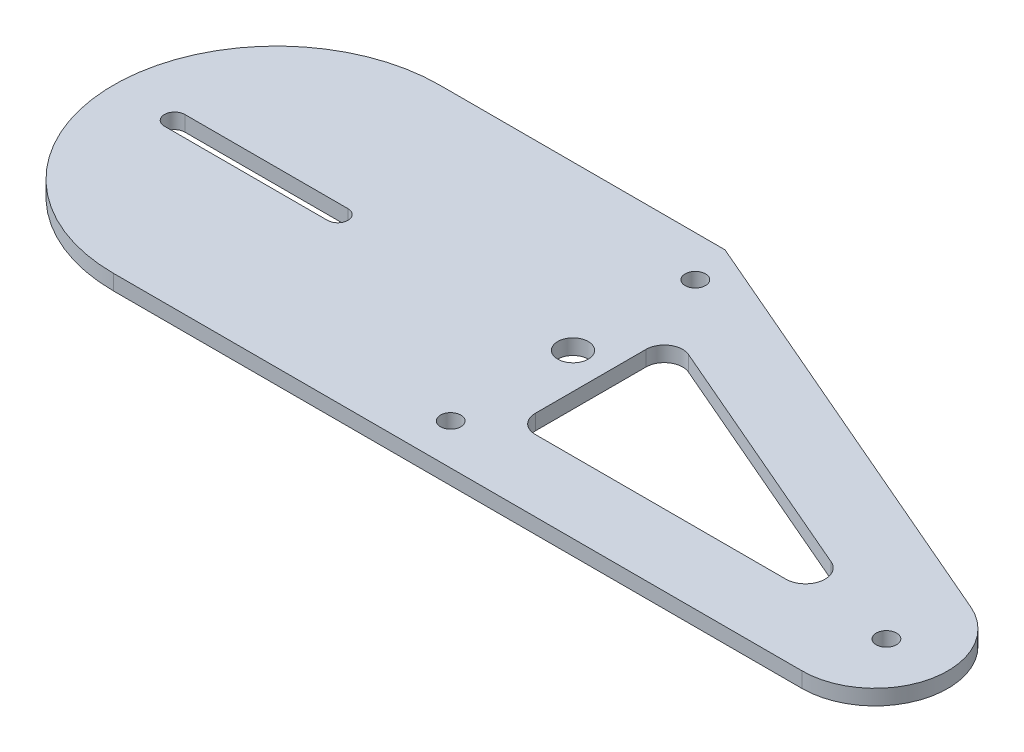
from build123d import *

# Parameters (mm, degrees)
SKETCH1_R      = 6.35
SKETCH1_R_2    = 9.525
EXTRUDE1_DEPTH = 9.525


with BuildPart() as part:
    # Sketch1 → Extrude1 (new body)
    with BuildSketch(Plane(origin=(0, 0, 0), x_dir=(1, 0, 0), z_dir=(0, 1, 0))):
        with BuildLine():
            Line((-184.702735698, -44.45), (244.363682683, -44.45))
            ThreePointArc((244.363682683, -44.45), (288.813682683, -8.240296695), (262.340333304, 42.613482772))
            Line((262.340333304, 42.613482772), (-6.300781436, 158.490350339))
            ThreePointArc((-6.300781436, 158.490350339), (-6.916278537, 158.684410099), (-7.558301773, 158.75))
            Line((-7.558301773, 158.75), (-184.702735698, 158.75))
            ThreePointArc((-184.702735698, 158.75), (-286.302735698, 57.15), (-184.702735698, -44.45))
        make_face()
        with Locations(Location((0, 133.35, 0), (0, 0, 270))):
            Circle(SKETCH1_R, mode=Mode.SUBTRACT)
        with Locations(Location((0, -19.05, 0), (0, 0, 270))):
            Circle(SKETCH1_R, mode=Mode.SUBTRACT)
        with Locations(Location((0, 57.15, 0), (0, 0, 270))):
            Circle(SKETCH1_R_2, mode=Mode.SUBTRACT)
        with Locations(Location((253.352007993, -0.918258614, 0), (0, 0, 270))):
            Circle(SKETCH1_R, mode=Mode.SUBTRACT)
        with BuildLine():
            Line((33.655, 0), (189.798129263, 0))
            ThreePointArc((189.798129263, 0), (201.75019991, 9.736353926), (194.63183451, 23.41032389))
            Line((194.63183451, 23.41032389), (38.182073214, 90.894068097))
            ThreePointArc((38.182073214, 90.894068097), (27.374058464, 89.948397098), (22.225, 80.398806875))
            Line((22.225, 80.398806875), (22.225, 11.43))
            ThreePointArc((22.225, 11.43), (25.572769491, 3.347769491), (33.655, 0))
        make_face(mode=Mode.SUBTRACT)
        with BuildLine():
            Line((-248.202735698, 63.5), (-146.602735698, 63.5))
            ThreePointArc((-146.602735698, 63.5), (-140.252735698, 57.15), (-146.602735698, 50.8))
            Line((-146.602735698, 50.8), (-248.202735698, 50.8))
            ThreePointArc((-248.202735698, 50.8), (-254.552735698, 57.15), (-248.202735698, 63.5))
        make_face(mode=Mode.SUBTRACT)
    extrude(amount=EXTRUDE1_DEPTH)


solid = part.part
